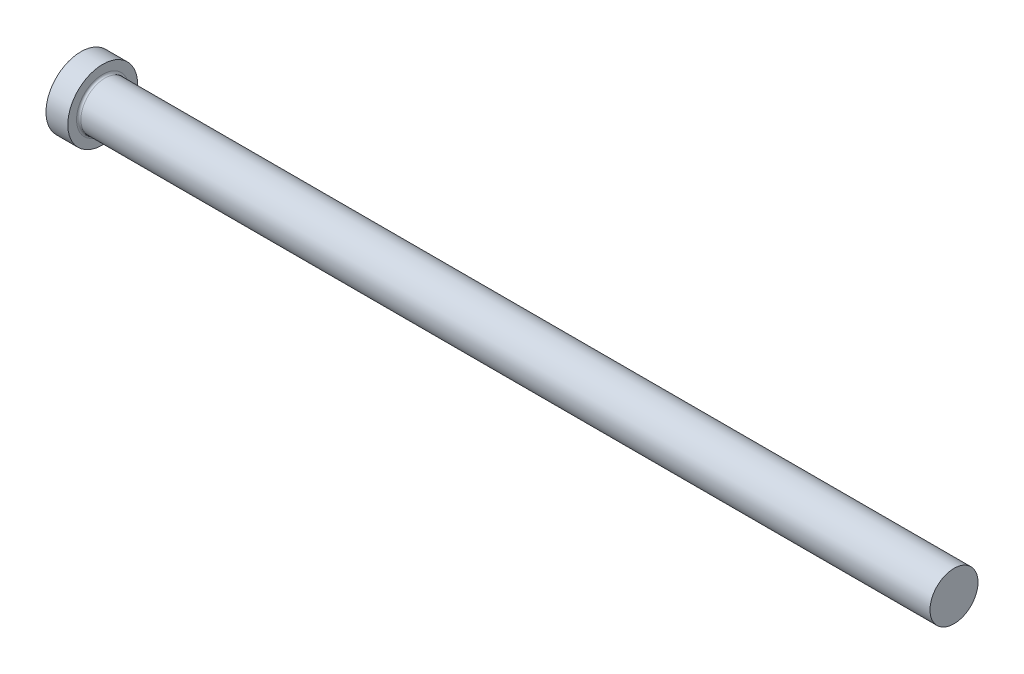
ISO-10303-21;
HEADER;
FILE_DESCRIPTION(('STEP AP214'),'2;1');
FILE_NAME('part.step','',(''),(''),'','','');
FILE_SCHEMA(('AUTOMOTIVE_DESIGN { 1 0 10303 214 1 1 1 1 }'));
ENDSEC;
DATA;
#1=APPLICATION_CONTEXT('core data for automotive mechanical design processes');
#2=APPLICATION_PROTOCOL_DEFINITION('international standard','automotive_design',2000,#1);
#3=PRODUCT_CONTEXT('',#1,'mechanical');
#4=PRODUCT('Part','Part','',(#3));
#5=PRODUCT_RELATED_PRODUCT_CATEGORY('part','',(#4));
#6=PRODUCT_DEFINITION_FORMATION('','',#4);
#7=PRODUCT_DEFINITION_CONTEXT('part definition',#1,'design');
#8=PRODUCT_DEFINITION('design','',#6,#7);
#9=PRODUCT_DEFINITION_SHAPE('','',#8);
#10=(LENGTH_UNIT() NAMED_UNIT(*) SI_UNIT(.MILLI.,.METRE.));
#11=(NAMED_UNIT(*) PLANE_ANGLE_UNIT() SI_UNIT($,.RADIAN.));
#12=(NAMED_UNIT(*) SI_UNIT($,.STERADIAN.) SOLID_ANGLE_UNIT());
#13=UNCERTAINTY_MEASURE_WITH_UNIT(LENGTH_MEASURE(1.E-05),#10,'distance_accuracy_value','');
#14=(GEOMETRIC_REPRESENTATION_CONTEXT(3) GLOBAL_UNCERTAINTY_ASSIGNED_CONTEXT((#13)) GLOBAL_UNIT_ASSIGNED_CONTEXT((#10,
#11,#12)) REPRESENTATION_CONTEXT('',''));
#15=CARTESIAN_POINT('',(0.,0.,0.));
#16=DIRECTION('',(0.,0.,1.));
#17=DIRECTION('',(1.,0.,0.));
#18=AXIS2_PLACEMENT_3D('',#15,#16,#17);
#19=CARTESIAN_POINT('',(0.,0.,0.));
#20=DIRECTION('',(-1.,0.,0.));
#21=DIRECTION('',(0.,-1.,0.));
#22=AXIS2_PLACEMENT_3D('',#19,#20,#21);
#23=PLANE('',#22);
#24=CARTESIAN_POINT('',(0.,0.,0.));
#25=DIRECTION('',(1.,0.,0.));
#26=DIRECTION('',(0.,1.,0.));
#27=AXIS2_PLACEMENT_3D('',#24,#25,#26);
#28=CIRCLE('',#27,8.);
#29=CARTESIAN_POINT('',(0.,8.,0.));
#30=VERTEX_POINT('',#29);
#31=EDGE_CURVE('E25',#30,#30,#28,.T.);
#32=ORIENTED_EDGE('',*,*,#31,.F.);
#33=EDGE_LOOP('',(#32));
#34=FACE_BOUND('',#33,.T.);
#35=ADVANCED_FACE('F14',(#34),#23,.T.);
#36=CARTESIAN_POINT('',(200.,0.,0.));
#37=DIRECTION('',(1.,0.,0.));
#38=DIRECTION('',(0.,1.,0.));
#39=AXIS2_PLACEMENT_3D('',#36,#37,#38);
#40=CYLINDRICAL_SURFACE('',#39,8.);
#41=ORIENTED_EDGE('',*,*,#31,.T.);
#42=EDGE_LOOP('',(#41));
#43=FACE_BOUND('',#42,.T.);
#44=CARTESIAN_POINT('',(5.,0.,0.));
#45=DIRECTION('',(1.,0.,0.));
#46=DIRECTION('',(0.,1.,0.));
#47=AXIS2_PLACEMENT_3D('',#44,#45,#46);
#48=CIRCLE('',#47,8.);
#49=CARTESIAN_POINT('',(5.,8.,0.));
#50=VERTEX_POINT('',#49);
#51=EDGE_CURVE('E29',#50,#50,#48,.T.);
#52=ORIENTED_EDGE('',*,*,#51,.F.);
#53=EDGE_LOOP('',(#52));
#54=FACE_BOUND('',#53,.T.);
#55=ADVANCED_FACE('F51',(#43,#54),#40,.T.);
#56=CARTESIAN_POINT('',(5.,8.,0.));
#57=DIRECTION('',(1.,0.,0.));
#58=DIRECTION('',(0.,1.,0.));
#59=AXIS2_PLACEMENT_3D('',#56,#57,#58);
#60=PLANE('',#59);
#61=CARTESIAN_POINT('',(5.,0.,0.));
#62=DIRECTION('',(1.,0.,0.));
#63=DIRECTION('',(0.,1.,0.));
#64=AXIS2_PLACEMENT_3D('',#61,#62,#63);
#65=CIRCLE('',#64,6.);
#66=CARTESIAN_POINT('',(5.,6.,0.));
#67=VERTEX_POINT('',#66);
#68=EDGE_CURVE('E9',#67,#67,#65,.F.);
#69=ORIENTED_EDGE('',*,*,#68,.T.);
#70=EDGE_LOOP('',(#69));
#71=FACE_BOUND('',#70,.T.);
#72=ORIENTED_EDGE('',*,*,#51,.T.);
#73=EDGE_LOOP('',(#72));
#74=FACE_BOUND('',#73,.T.);
#75=ADVANCED_FACE('F42',(#71,#74),#60,.T.);
#76=CARTESIAN_POINT('',(200.,0.,0.));
#77=DIRECTION('',(1.,0.,0.));
#78=DIRECTION('',(0.,1.,0.));
#79=AXIS2_PLACEMENT_3D('',#76,#77,#78);
#80=CYLINDRICAL_SURFACE('',#79,5.49999999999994);
#81=CARTESIAN_POINT('',(5.5,0.,0.));
#82=DIRECTION('',(1.,0.,0.));
#83=DIRECTION('',(0.,1.,0.));
#84=AXIS2_PLACEMENT_3D('',#81,#82,#83);
#85=CIRCLE('',#84,5.49999999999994);
#86=CARTESIAN_POINT('',(5.5,5.49999999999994,0.));
#87=VERTEX_POINT('',#86);
#88=EDGE_CURVE('E21',#87,#87,#85,.T.);
#89=ORIENTED_EDGE('',*,*,#88,.T.);
#90=EDGE_LOOP('',(#89));
#91=FACE_BOUND('',#90,.T.);
#92=CARTESIAN_POINT('',(200.,0.,0.));
#93=DIRECTION('',(1.,0.,0.));
#94=DIRECTION('',(0.,1.,0.));
#95=AXIS2_PLACEMENT_3D('',#92,#93,#94);
#96=CIRCLE('',#95,5.5);
#97=CARTESIAN_POINT('',(200.,5.50000000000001,0.));
#98=VERTEX_POINT('',#97);
#99=EDGE_CURVE('E34',#98,#98,#96,.T.);
#100=ORIENTED_EDGE('',*,*,#99,.F.);
#101=EDGE_LOOP('',(#100));
#102=FACE_BOUND('',#101,.T.);
#103=ADVANCED_FACE('F40',(#91,#102),#80,.T.);
#104=CARTESIAN_POINT('',(200.,5.5,0.));
#105=DIRECTION('',(1.,0.,0.));
#106=DIRECTION('',(0.,1.,0.));
#107=AXIS2_PLACEMENT_3D('',#104,#105,#106);
#108=PLANE('',#107);
#109=ORIENTED_EDGE('',*,*,#99,.T.);
#110=EDGE_LOOP('',(#109));
#111=FACE_BOUND('',#110,.T.);
#112=ADVANCED_FACE('F38',(#111),#108,.T.);
#113=CARTESIAN_POINT('',(5.5,0.,0.));
#114=DIRECTION('',(1.,0.,0.));
#115=DIRECTION('',(0.,1.,0.));
#116=AXIS2_PLACEMENT_3D('',#113,#114,#115);
#117=TOROIDAL_SURFACE('',#116,6.,0.5);
#118=ORIENTED_EDGE('',*,*,#68,.F.);
#119=EDGE_LOOP('',(#118));
#120=FACE_BOUND('',#119,.T.);
#121=ORIENTED_EDGE('',*,*,#88,.F.);
#122=EDGE_LOOP('',(#121));
#123=FACE_BOUND('',#122,.T.);
#124=ADVANCED_FACE('F16',(#120,#123),#117,.F.);
#125=CLOSED_SHELL('',(#35,#55,#75,#103,#112,#124));
#126=MANIFOLD_SOLID_BREP('B1',#125);
#127=ADVANCED_BREP_SHAPE_REPRESENTATION('',(#18,#126),#14);
#128=SHAPE_DEFINITION_REPRESENTATION(#9,#127);
ENDSEC;
END-ISO-10303-21;
